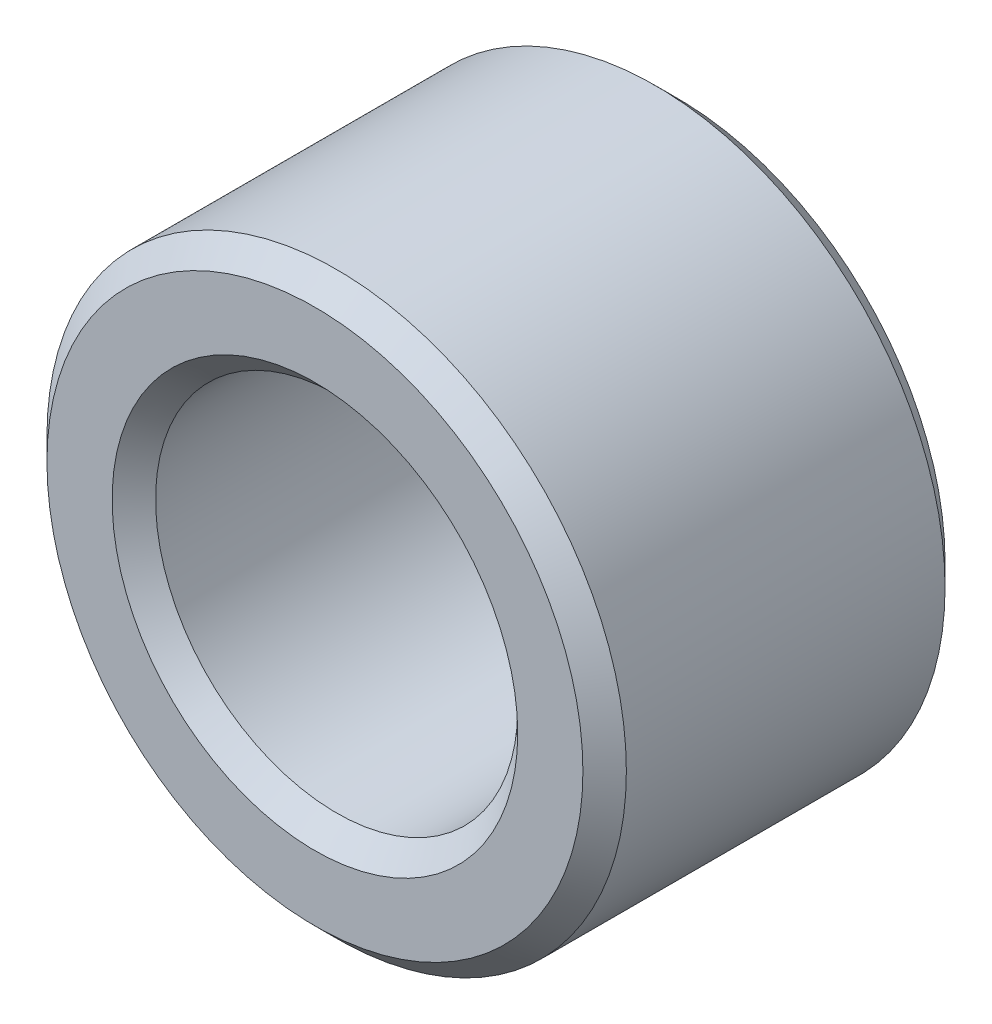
ISO-10303-21;
HEADER;
FILE_DESCRIPTION(('STEP AP214'),'2;1');
FILE_NAME('part.step','',(''),(''),'','','');
FILE_SCHEMA(('AUTOMOTIVE_DESIGN { 1 0 10303 214 1 1 1 1 }'));
ENDSEC;
DATA;
#1=APPLICATION_CONTEXT('core data for automotive mechanical design processes');
#2=APPLICATION_PROTOCOL_DEFINITION('international standard','automotive_design',2000,#1);
#3=PRODUCT_CONTEXT('',#1,'mechanical');
#4=PRODUCT('Part','Part','',(#3));
#5=PRODUCT_RELATED_PRODUCT_CATEGORY('part','',(#4));
#6=PRODUCT_DEFINITION_FORMATION('','',#4);
#7=PRODUCT_DEFINITION_CONTEXT('part definition',#1,'design');
#8=PRODUCT_DEFINITION('design','',#6,#7);
#9=PRODUCT_DEFINITION_SHAPE('','',#8);
#10=(LENGTH_UNIT() NAMED_UNIT(*) SI_UNIT(.MILLI.,.METRE.));
#11=(NAMED_UNIT(*) PLANE_ANGLE_UNIT() SI_UNIT($,.RADIAN.));
#12=(NAMED_UNIT(*) SI_UNIT($,.STERADIAN.) SOLID_ANGLE_UNIT());
#13=UNCERTAINTY_MEASURE_WITH_UNIT(LENGTH_MEASURE(1.E-05),#10,'distance_accuracy_value','');
#14=(GEOMETRIC_REPRESENTATION_CONTEXT(3) GLOBAL_UNCERTAINTY_ASSIGNED_CONTEXT((#13)) GLOBAL_UNIT_ASSIGNED_CONTEXT((#10,
#11,#12)) REPRESENTATION_CONTEXT('',''));
#15=CARTESIAN_POINT('',(0.,0.,0.));
#16=DIRECTION('',(0.,0.,1.));
#17=DIRECTION('',(1.,0.,0.));
#18=AXIS2_PLACEMENT_3D('',#15,#16,#17);
#19=CARTESIAN_POINT('',(0.,0.,5.));
#20=DIRECTION('',(0.,0.,1.));
#21=DIRECTION('',(1.,0.,0.));
#22=AXIS2_PLACEMENT_3D('',#19,#20,#21);
#23=PLANE('',#22);
#24=CARTESIAN_POINT('',(0.,0.,5.));
#25=DIRECTION('',(0.,0.,1.));
#26=DIRECTION('',(1.,0.,0.));
#27=AXIS2_PLACEMENT_3D('',#24,#25,#26);
#28=CIRCLE('',#27,3.69999999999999);
#29=CARTESIAN_POINT('',(3.69999999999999,0.,5.));
#30=VERTEX_POINT('',#29);
#31=EDGE_CURVE('E51',#30,#30,#28,.T.);
#32=ORIENTED_EDGE('',*,*,#31,.T.);
#33=EDGE_LOOP('',(#32));
#34=FACE_BOUND('',#33,.T.);
#35=CARTESIAN_POINT('',(0.,0.,5.));
#36=DIRECTION('',(0.,0.,1.));
#37=DIRECTION('',(1.,0.,0.));
#38=AXIS2_PLACEMENT_3D('',#35,#36,#37);
#39=CIRCLE('',#38,2.80000000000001);
#40=CARTESIAN_POINT('',(2.80000000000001,0.,5.));
#41=VERTEX_POINT('',#40);
#42=EDGE_CURVE('E54',#41,#41,#39,.F.);
#43=ORIENTED_EDGE('',*,*,#42,.T.);
#44=EDGE_LOOP('',(#43));
#45=FACE_BOUND('',#44,.T.);
#46=ADVANCED_FACE('F25',(#34,#45),#23,.T.);
#47=CARTESIAN_POINT('',(0.,0.,0.));
#48=DIRECTION('',(0.,0.,1.));
#49=DIRECTION('',(1.,0.,0.));
#50=AXIS2_PLACEMENT_3D('',#47,#48,#49);
#51=PLANE('',#50);
#52=CARTESIAN_POINT('',(0.,0.,0.));
#53=DIRECTION('',(0.,0.,1.));
#54=DIRECTION('',(1.,0.,0.));
#55=AXIS2_PLACEMENT_3D('',#52,#53,#54);
#56=CIRCLE('',#55,3.69999999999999);
#57=CARTESIAN_POINT('',(3.69999999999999,0.,0.));
#58=VERTEX_POINT('',#57);
#59=EDGE_CURVE('E36',#58,#58,#56,.F.);
#60=ORIENTED_EDGE('',*,*,#59,.T.);
#61=EDGE_LOOP('',(#60));
#62=FACE_BOUND('',#61,.T.);
#63=CARTESIAN_POINT('',(0.,0.,0.));
#64=DIRECTION('',(0.,0.,1.));
#65=DIRECTION('',(1.,0.,0.));
#66=AXIS2_PLACEMENT_3D('',#63,#64,#65);
#67=CIRCLE('',#66,2.80000000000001);
#68=CARTESIAN_POINT('',(2.80000000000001,0.,0.));
#69=VERTEX_POINT('',#68);
#70=EDGE_CURVE('E40',#69,#69,#67,.T.);
#71=ORIENTED_EDGE('',*,*,#70,.T.);
#72=EDGE_LOOP('',(#71));
#73=FACE_BOUND('',#72,.T.);
#74=ADVANCED_FACE('F75',(#62,#73),#51,.F.);
#75=CARTESIAN_POINT('',(0.,0.,5.));
#76=DIRECTION('',(0.,0.,-1.));
#77=DIRECTION('',(-1.,0.,0.));
#78=AXIS2_PLACEMENT_3D('',#75,#76,#77);
#79=CYLINDRICAL_SURFACE('',#78,4.);
#80=CARTESIAN_POINT('',(0.,0.,4.7));
#81=DIRECTION('',(0.,0.,1.));
#82=DIRECTION('',(1.,0.,0.));
#83=AXIS2_PLACEMENT_3D('',#80,#81,#82);
#84=CIRCLE('',#83,4.);
#85=CARTESIAN_POINT('',(4.,0.,4.7));
#86=VERTEX_POINT('',#85);
#87=EDGE_CURVE('E45',#86,#86,#84,.F.);
#88=ORIENTED_EDGE('',*,*,#87,.T.);
#89=EDGE_LOOP('',(#88));
#90=FACE_BOUND('',#89,.T.);
#91=CARTESIAN_POINT('',(0.,0.,0.300000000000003));
#92=DIRECTION('',(0.,0.,1.));
#93=DIRECTION('',(1.,0.,0.));
#94=AXIS2_PLACEMENT_3D('',#91,#92,#93);
#95=CIRCLE('',#94,4.);
#96=CARTESIAN_POINT('',(4.,0.,0.300000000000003));
#97=VERTEX_POINT('',#96);
#98=EDGE_CURVE('E48',#97,#97,#95,.T.);
#99=ORIENTED_EDGE('',*,*,#98,.T.);
#100=EDGE_LOOP('',(#99));
#101=FACE_BOUND('',#100,.T.);
#102=ADVANCED_FACE('F27',(#90,#101),#79,.T.);
#103=CARTESIAN_POINT('',(0.,0.,5.));
#104=DIRECTION('',(0.,0.,-1.));
#105=DIRECTION('',(-1.,0.,0.));
#106=AXIS2_PLACEMENT_3D('',#103,#104,#105);
#107=CYLINDRICAL_SURFACE('',#106,2.5);
#108=CARTESIAN_POINT('',(0.,0.,4.7));
#109=DIRECTION('',(0.,0.,1.));
#110=DIRECTION('',(1.,0.,0.));
#111=AXIS2_PLACEMENT_3D('',#108,#109,#110);
#112=CIRCLE('',#111,2.5);
#113=CARTESIAN_POINT('',(2.5,0.,4.7));
#114=VERTEX_POINT('',#113);
#115=EDGE_CURVE('E10',#114,#114,#112,.T.);
#116=ORIENTED_EDGE('',*,*,#115,.T.);
#117=EDGE_LOOP('',(#116));
#118=FACE_BOUND('',#117,.T.);
#119=CARTESIAN_POINT('',(0.,0.,0.300000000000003));
#120=DIRECTION('',(0.,0.,1.));
#121=DIRECTION('',(1.,0.,0.));
#122=AXIS2_PLACEMENT_3D('',#119,#120,#121);
#123=CIRCLE('',#122,2.5);
#124=CARTESIAN_POINT('',(2.5,0.,0.300000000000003));
#125=VERTEX_POINT('',#124);
#126=EDGE_CURVE('E32',#125,#125,#123,.F.);
#127=ORIENTED_EDGE('',*,*,#126,.T.);
#128=EDGE_LOOP('',(#127));
#129=FACE_BOUND('',#128,.T.);
#130=ADVANCED_FACE('F83',(#118,#129),#107,.F.);
#131=CARTESIAN_POINT('',(0.,0.,5.));
#132=DIRECTION('',(0.,0.,-1.));
#133=DIRECTION('',(-1.,0.,0.));
#134=AXIS2_PLACEMENT_3D('',#131,#132,#133);
#135=CONICAL_SURFACE('',#134,3.69999999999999,0.785398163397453);
#136=ORIENTED_EDGE('',*,*,#87,.F.);
#137=EDGE_LOOP('',(#136));
#138=FACE_BOUND('',#137,.T.);
#139=ORIENTED_EDGE('',*,*,#31,.F.);
#140=EDGE_LOOP('',(#139));
#141=FACE_BOUND('',#140,.T.);
#142=ADVANCED_FACE('F71',(#138,#141),#135,.T.);
#143=CARTESIAN_POINT('',(0.,0.,0.300000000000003));
#144=DIRECTION('',(0.,0.,1.));
#145=DIRECTION('',(1.,0.,0.));
#146=AXIS2_PLACEMENT_3D('',#143,#144,#145);
#147=CONICAL_SURFACE('',#146,4.,0.785398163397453);
#148=ORIENTED_EDGE('',*,*,#59,.F.);
#149=EDGE_LOOP('',(#148));
#150=FACE_BOUND('',#149,.T.);
#151=ORIENTED_EDGE('',*,*,#98,.F.);
#152=EDGE_LOOP('',(#151));
#153=FACE_BOUND('',#152,.T.);
#154=ADVANCED_FACE('F63',(#150,#153),#147,.T.);
#155=CARTESIAN_POINT('',(0.,0.,4.7));
#156=DIRECTION('',(0.,0.,1.));
#157=DIRECTION('',(1.,0.,0.));
#158=AXIS2_PLACEMENT_3D('',#155,#156,#157);
#159=CONICAL_SURFACE('',#158,2.5,0.785398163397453);
#160=ORIENTED_EDGE('',*,*,#42,.F.);
#161=EDGE_LOOP('',(#160));
#162=FACE_BOUND('',#161,.T.);
#163=ORIENTED_EDGE('',*,*,#115,.F.);
#164=EDGE_LOOP('',(#163));
#165=FACE_BOUND('',#164,.T.);
#166=ADVANCED_FACE('F59',(#162,#165),#159,.F.);
#167=CARTESIAN_POINT('',(0.,0.,0.));
#168=DIRECTION('',(0.,0.,-1.));
#169=DIRECTION('',(-1.,0.,0.));
#170=AXIS2_PLACEMENT_3D('',#167,#168,#169);
#171=CONICAL_SURFACE('',#170,2.80000000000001,0.785398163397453);
#172=ORIENTED_EDGE('',*,*,#126,.F.);
#173=EDGE_LOOP('',(#172));
#174=FACE_BOUND('',#173,.T.);
#175=ORIENTED_EDGE('',*,*,#70,.F.);
#176=EDGE_LOOP('',(#175));
#177=FACE_BOUND('',#176,.T.);
#178=ADVANCED_FACE('F62',(#174,#177),#171,.F.);
#179=CLOSED_SHELL('',(#46,#74,#102,#130,#142,#154,#166,#178));
#180=MANIFOLD_SOLID_BREP('B2',#179);
#181=ADVANCED_BREP_SHAPE_REPRESENTATION('',(#18,#180),#14);
#182=SHAPE_DEFINITION_REPRESENTATION(#9,#181);
ENDSEC;
END-ISO-10303-21;
